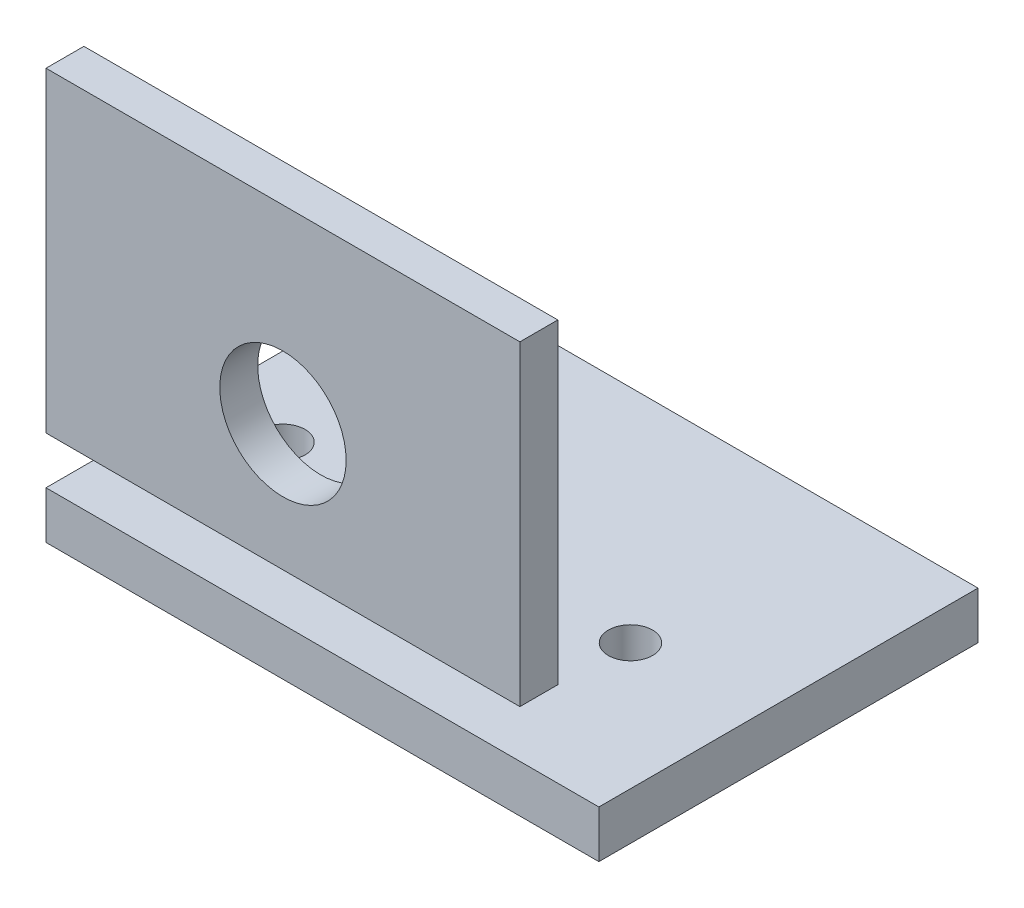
from build123d import *

# Parameters (mm, degrees)
BASESKETCH_W        = 175
BASESKETCH_H        = 120
BASEBOSS_DEPTH      = 15
MOUNTHOLESSKETCH_R  = 7
MOUNTHOLESCUT_DEPTH = 15
UPRIGHTSKETCH_W     = 150
UPRIGHTSKETCH_H     = 100
UPRIGHTBOSS_DEPTH   = 12
SHAFTBORESKETCH_R   = 20
SHAFTBORECUT_DEPTH  = 12


with BuildPart() as part:
    # BaseSketch → BaseBoss (new body)
    with BuildSketch(Plane(origin=(0, 0, 0), x_dir=(1, 0, 0), z_dir=(0, 1, 0))):
        with Locations((87.5, 60)):
            Rectangle(BASESKETCH_W, BASESKETCH_H)
    extrude(amount=-BASEBOSS_DEPTH)

    # MountHolesSketch → MountHolesCut (cut)
    with BuildSketch(Plane(origin=(0, 0, 0), x_dir=(1, 0, 0), z_dir=(0, 1, 0))):
        with Locations(Location((25, 50, 0), (0, 0, 270))):
            Circle(MOUNTHOLESSKETCH_R)
        with Locations(Location((135, 50, 0), (0, 0, 270))):
            Circle(MOUNTHOLESSKETCH_R)
    extrude(amount=-MOUNTHOLESCUT_DEPTH, mode=Mode.SUBTRACT)


with BuildPart() as body_2:
    # UprightSketch → UprightBoss (new body)
    with BuildSketch(Plane.XY):
        with Locations((75, 65)):
            Rectangle(UPRIGHTSKETCH_W, UPRIGHTSKETCH_H)
    extrude(amount=-UPRIGHTBOSS_DEPTH)

    # ShaftBoreSketch → ShaftBoreCut (cut)
    with BuildSketch(Plane.XY):
        with Locations((75, 55)):
            Circle(SHAFTBORESKETCH_R)
    extrude(amount=-SHAFTBORECUT_DEPTH, mode=Mode.SUBTRACT)


solid = Compound([part.part, body_2.part])
